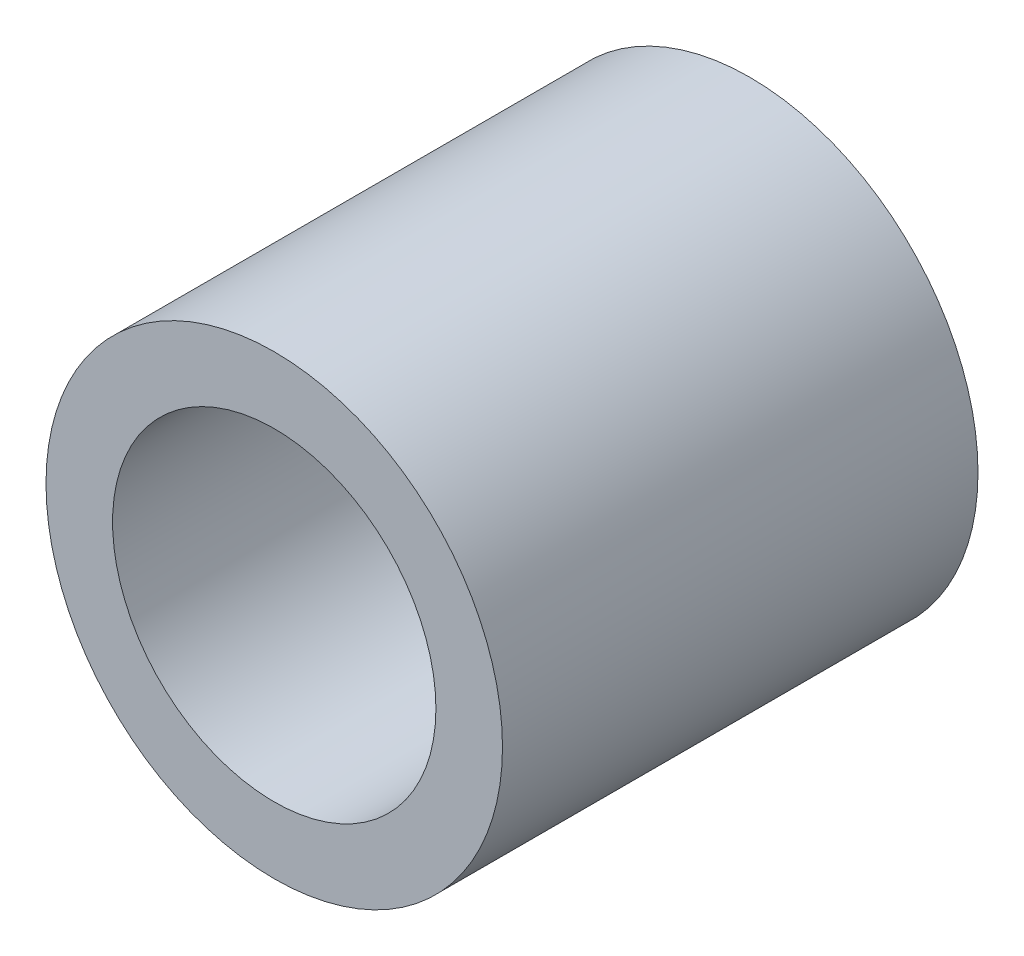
from build123d import *

# Parameters (mm, degrees)
ESQUISSE1_R      = 12
ESQUISSE1_R_2    = 8.5
EXTRUSION1_DEPTH = 12.5


with BuildPart() as part:
    # Esquisse1 → Extrusion1 (new, symmetric)
    with BuildSketch(Plane.XY):
        Circle(ESQUISSE1_R)
        Circle(ESQUISSE1_R_2, mode=Mode.SUBTRACT)
    extrude(amount=EXTRUSION1_DEPTH, both=True)


solid = part.part
